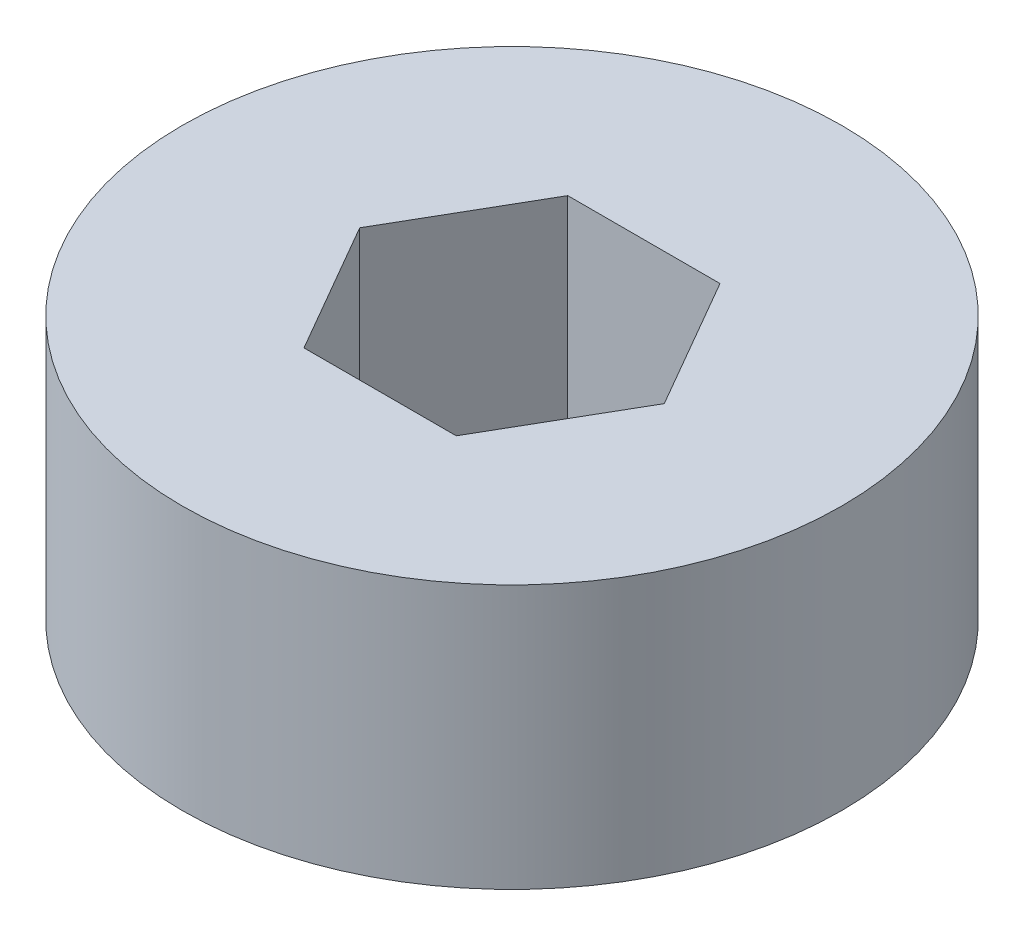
ISO-10303-21;
HEADER;
FILE_DESCRIPTION(('STEP AP214'),'2;1');
FILE_NAME('part.step','',(''),(''),'','','');
FILE_SCHEMA(('AUTOMOTIVE_DESIGN { 1 0 10303 214 1 1 1 1 }'));
ENDSEC;
DATA;
#1=APPLICATION_CONTEXT('core data for automotive mechanical design processes');
#2=APPLICATION_PROTOCOL_DEFINITION('international standard','automotive_design',2000,#1);
#3=PRODUCT_CONTEXT('',#1,'mechanical');
#4=PRODUCT('Part','Part','',(#3));
#5=PRODUCT_RELATED_PRODUCT_CATEGORY('part','',(#4));
#6=PRODUCT_DEFINITION_FORMATION('','',#4);
#7=PRODUCT_DEFINITION_CONTEXT('part definition',#1,'design');
#8=PRODUCT_DEFINITION('design','',#6,#7);
#9=PRODUCT_DEFINITION_SHAPE('','',#8);
#10=(LENGTH_UNIT() NAMED_UNIT(*) SI_UNIT(.MILLI.,.METRE.));
#11=(NAMED_UNIT(*) PLANE_ANGLE_UNIT() SI_UNIT($,.RADIAN.));
#12=(NAMED_UNIT(*) SI_UNIT($,.STERADIAN.) SOLID_ANGLE_UNIT());
#13=UNCERTAINTY_MEASURE_WITH_UNIT(LENGTH_MEASURE(1.E-05),#10,'distance_accuracy_value','');
#14=(GEOMETRIC_REPRESENTATION_CONTEXT(3) GLOBAL_UNCERTAINTY_ASSIGNED_CONTEXT((#13)) GLOBAL_UNIT_ASSIGNED_CONTEXT((#10,
#11,#12)) REPRESENTATION_CONTEXT('',''));
#15=CARTESIAN_POINT('',(0.,0.,0.));
#16=DIRECTION('',(0.,0.,1.));
#17=DIRECTION('',(1.,0.,0.));
#18=AXIS2_PLACEMENT_3D('',#15,#16,#17);
#19=CARTESIAN_POINT('',(0.,10.,0.));
#20=DIRECTION('',(0.,-1.,0.));
#21=DIRECTION('',(0.,0.,-1.));
#22=AXIS2_PLACEMENT_3D('',#19,#20,#21);
#23=CYLINDRICAL_SURFACE('',#22,12.5);
#24=CARTESIAN_POINT('',(0.,10.,0.));
#25=DIRECTION('',(0.,1.,0.));
#26=DIRECTION('',(0.,0.,1.));
#27=AXIS2_PLACEMENT_3D('',#24,#25,#26);
#28=CIRCLE('',#27,12.5);
#29=CARTESIAN_POINT('',(0.,10.,12.5));
#30=VERTEX_POINT('',#29);
#31=EDGE_CURVE('E11',#30,#30,#28,.T.);
#32=ORIENTED_EDGE('',*,*,#31,.F.);
#33=EDGE_LOOP('',(#32));
#34=FACE_BOUND('',#33,.T.);
#35=CARTESIAN_POINT('',(0.,0.,0.));
#36=DIRECTION('',(0.,1.,0.));
#37=DIRECTION('',(0.,0.,1.));
#38=AXIS2_PLACEMENT_3D('',#35,#36,#37);
#39=CIRCLE('',#38,12.5);
#40=CARTESIAN_POINT('',(0.,0.,12.5));
#41=VERTEX_POINT('',#40);
#42=EDGE_CURVE('E35',#41,#41,#39,.T.);
#43=ORIENTED_EDGE('',*,*,#42,.T.);
#44=EDGE_LOOP('',(#43));
#45=FACE_BOUND('',#44,.T.);
#46=ADVANCED_FACE('F28',(#34,#45),#23,.T.);
#47=CARTESIAN_POINT('',(0.,10.,0.));
#48=DIRECTION('',(0.,1.,0.));
#49=DIRECTION('',(0.,0.,1.));
#50=AXIS2_PLACEMENT_3D('',#47,#48,#49);
#51=PLANE('',#50);
#52=DIRECTION('',(0.5,0.,-0.866025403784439));
#53=VECTOR('',#52,1.);
#54=CARTESIAN_POINT('',(2.88675134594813,10.,5.));
#55=LINE('',#54,#53);
#56=CARTESIAN_POINT('',(2.88675134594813,10.,5.));
#57=VERTEX_POINT('',#56);
#58=CARTESIAN_POINT('',(5.77350269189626,10.,0.));
#59=VERTEX_POINT('',#58);
#60=EDGE_CURVE('E42',#57,#59,#55,.T.);
#61=ORIENTED_EDGE('',*,*,#60,.F.);
#62=DIRECTION('',(1.,0.,0.));
#63=VECTOR('',#62,1.);
#64=CARTESIAN_POINT('',(-2.88675134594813,10.,5.));
#65=LINE('',#64,#63);
#66=CARTESIAN_POINT('',(-2.88675134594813,10.,5.));
#67=VERTEX_POINT('',#66);
#68=EDGE_CURVE('E107',#67,#57,#65,.T.);
#69=ORIENTED_EDGE('',*,*,#68,.F.);
#70=DIRECTION('',(0.5,0.,0.866025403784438));
#71=VECTOR('',#70,1.);
#72=CARTESIAN_POINT('',(-5.77350269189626,10.,0.));
#73=LINE('',#72,#71);
#74=CARTESIAN_POINT('',(-5.77350269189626,10.,0.));
#75=VERTEX_POINT('',#74);
#76=EDGE_CURVE('E101',#75,#67,#73,.T.);
#77=ORIENTED_EDGE('',*,*,#76,.F.);
#78=DIRECTION('',(-0.5,0.,0.866025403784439));
#79=VECTOR('',#78,1.);
#80=CARTESIAN_POINT('',(-2.88675134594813,10.,-5.));
#81=LINE('',#80,#79);
#82=CARTESIAN_POINT('',(-2.88675134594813,10.,-5.));
#83=VERTEX_POINT('',#82);
#84=EDGE_CURVE('E99',#83,#75,#81,.T.);
#85=ORIENTED_EDGE('',*,*,#84,.F.);
#86=DIRECTION('',(-1.,0.,0.));
#87=VECTOR('',#86,1.);
#88=CARTESIAN_POINT('',(2.88675134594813,10.,-5.));
#89=LINE('',#88,#87);
#90=CARTESIAN_POINT('',(2.88675134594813,10.,-5.));
#91=VERTEX_POINT('',#90);
#92=EDGE_CURVE('E82',#91,#83,#89,.T.);
#93=ORIENTED_EDGE('',*,*,#92,.F.);
#94=DIRECTION('',(-0.5,0.,-0.866025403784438));
#95=VECTOR('',#94,1.);
#96=CARTESIAN_POINT('',(5.77350269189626,10.,0.));
#97=LINE('',#96,#95);
#98=EDGE_CURVE('E91',#59,#91,#97,.T.);
#99=ORIENTED_EDGE('',*,*,#98,.F.);
#100=EDGE_LOOP('',(#61,#69,#77,#85,#93,#99));
#101=FACE_BOUND('',#100,.T.);
#102=ORIENTED_EDGE('',*,*,#31,.T.);
#103=EDGE_LOOP('',(#102));
#104=FACE_BOUND('',#103,.T.);
#105=ADVANCED_FACE('F95',(#101,#104),#51,.T.);
#106=CARTESIAN_POINT('',(0.,0.,0.));
#107=DIRECTION('',(0.,1.,0.));
#108=DIRECTION('',(0.,0.,1.));
#109=AXIS2_PLACEMENT_3D('',#106,#107,#108);
#110=PLANE('',#109);
#111=DIRECTION('',(1.,0.,0.));
#112=VECTOR('',#111,1.);
#113=CARTESIAN_POINT('',(-2.88675134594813,0.,5.));
#114=LINE('',#113,#112);
#115=CARTESIAN_POINT('',(-2.88675134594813,0.,5.));
#116=VERTEX_POINT('',#115);
#117=CARTESIAN_POINT('',(2.88675134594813,0.,5.));
#118=VERTEX_POINT('',#117);
#119=EDGE_CURVE('E122',#116,#118,#114,.T.);
#120=ORIENTED_EDGE('',*,*,#119,.T.);
#121=DIRECTION('',(0.5,0.,-0.866025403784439));
#122=VECTOR('',#121,1.);
#123=CARTESIAN_POINT('',(2.88675134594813,0.,5.));
#124=LINE('',#123,#122);
#125=CARTESIAN_POINT('',(5.77350269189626,0.,0.));
#126=VERTEX_POINT('',#125);
#127=EDGE_CURVE('E110',#118,#126,#124,.T.);
#128=ORIENTED_EDGE('',*,*,#127,.T.);
#129=DIRECTION('',(-0.5,0.,-0.866025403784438));
#130=VECTOR('',#129,1.);
#131=CARTESIAN_POINT('',(5.77350269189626,0.,0.));
#132=LINE('',#131,#130);
#133=CARTESIAN_POINT('',(2.88675134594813,0.,-5.));
#134=VERTEX_POINT('',#133);
#135=EDGE_CURVE('E113',#126,#134,#132,.T.);
#136=ORIENTED_EDGE('',*,*,#135,.T.);
#137=DIRECTION('',(-1.,0.,0.));
#138=VECTOR('',#137,1.);
#139=CARTESIAN_POINT('',(2.88675134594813,0.,-5.));
#140=LINE('',#139,#138);
#141=CARTESIAN_POINT('',(-2.88675134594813,0.,-5.));
#142=VERTEX_POINT('',#141);
#143=EDGE_CURVE('E50',#134,#142,#140,.T.);
#144=ORIENTED_EDGE('',*,*,#143,.T.);
#145=DIRECTION('',(-0.5,0.,0.866025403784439));
#146=VECTOR('',#145,1.);
#147=CARTESIAN_POINT('',(-2.88675134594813,0.,-5.));
#148=LINE('',#147,#146);
#149=CARTESIAN_POINT('',(-5.77350269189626,0.,0.));
#150=VERTEX_POINT('',#149);
#151=EDGE_CURVE('E116',#142,#150,#148,.T.);
#152=ORIENTED_EDGE('',*,*,#151,.T.);
#153=DIRECTION('',(0.5,0.,0.866025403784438));
#154=VECTOR('',#153,1.);
#155=CARTESIAN_POINT('',(-5.77350269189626,0.,0.));
#156=LINE('',#155,#154);
#157=EDGE_CURVE('E119',#150,#116,#156,.T.);
#158=ORIENTED_EDGE('',*,*,#157,.T.);
#159=EDGE_LOOP('',(#120,#128,#136,#144,#152,#158));
#160=FACE_BOUND('',#159,.T.);
#161=ORIENTED_EDGE('',*,*,#42,.F.);
#162=EDGE_LOOP('',(#161));
#163=FACE_BOUND('',#162,.T.);
#164=ADVANCED_FACE('F136',(#160,#163),#110,.F.);
#165=CARTESIAN_POINT('',(2.88675134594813,0.,5.));
#166=DIRECTION('',(0.866025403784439,0.,0.5));
#167=DIRECTION('',(0.5,0.,-0.866025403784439));
#168=AXIS2_PLACEMENT_3D('',#165,#166,#167);
#169=PLANE('',#168);
#170=ORIENTED_EDGE('',*,*,#60,.T.);
#171=DIRECTION('',(0.,1.,0.));
#172=VECTOR('',#171,1.);
#173=CARTESIAN_POINT('',(5.77350269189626,0.,0.));
#174=LINE('',#173,#172);
#175=EDGE_CURVE('E88',#126,#59,#174,.T.);
#176=ORIENTED_EDGE('',*,*,#175,.F.);
#177=ORIENTED_EDGE('',*,*,#127,.F.);
#178=DIRECTION('',(0.,1.,0.));
#179=VECTOR('',#178,1.);
#180=CARTESIAN_POINT('',(2.88675134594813,0.,5.));
#181=LINE('',#180,#179);
#182=EDGE_CURVE('E125',#118,#57,#181,.T.);
#183=ORIENTED_EDGE('',*,*,#182,.T.);
#184=EDGE_LOOP('',(#170,#176,#177,#183));
#185=FACE_BOUND('',#184,.T.);
#186=ADVANCED_FACE('F138',(#185),#169,.F.);
#187=CARTESIAN_POINT('',(-2.88675134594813,0.,5.));
#188=DIRECTION('',(0.,0.,1.));
#189=DIRECTION('',(1.,0.,0.));
#190=AXIS2_PLACEMENT_3D('',#187,#188,#189);
#191=PLANE('',#190);
#192=ORIENTED_EDGE('',*,*,#68,.T.);
#193=ORIENTED_EDGE('',*,*,#182,.F.);
#194=ORIENTED_EDGE('',*,*,#119,.F.);
#195=DIRECTION('',(0.,1.,0.));
#196=VECTOR('',#195,1.);
#197=CARTESIAN_POINT('',(-2.88675134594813,0.,5.));
#198=LINE('',#197,#196);
#199=EDGE_CURVE('E127',#116,#67,#198,.T.);
#200=ORIENTED_EDGE('',*,*,#199,.T.);
#201=EDGE_LOOP('',(#192,#193,#194,#200));
#202=FACE_BOUND('',#201,.T.);
#203=ADVANCED_FACE('F145',(#202),#191,.F.);
#204=CARTESIAN_POINT('',(-5.77350269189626,0.,0.));
#205=DIRECTION('',(-0.866025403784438,0.,0.5));
#206=DIRECTION('',(0.5,0.,0.866025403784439));
#207=AXIS2_PLACEMENT_3D('',#204,#205,#206);
#208=PLANE('',#207);
#209=ORIENTED_EDGE('',*,*,#76,.T.);
#210=ORIENTED_EDGE('',*,*,#199,.F.);
#211=ORIENTED_EDGE('',*,*,#157,.F.);
#212=DIRECTION('',(0.,1.,0.));
#213=VECTOR('',#212,1.);
#214=CARTESIAN_POINT('',(-5.77350269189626,0.,0.));
#215=LINE('',#214,#213);
#216=EDGE_CURVE('E129',#150,#75,#215,.T.);
#217=ORIENTED_EDGE('',*,*,#216,.T.);
#218=EDGE_LOOP('',(#209,#210,#211,#217));
#219=FACE_BOUND('',#218,.T.);
#220=ADVANCED_FACE('F169',(#219),#208,.F.);
#221=CARTESIAN_POINT('',(-2.88675134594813,0.,-5.));
#222=DIRECTION('',(-0.866025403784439,0.,-0.5));
#223=DIRECTION('',(-0.5,0.,0.866025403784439));
#224=AXIS2_PLACEMENT_3D('',#221,#222,#223);
#225=PLANE('',#224);
#226=ORIENTED_EDGE('',*,*,#84,.T.);
#227=ORIENTED_EDGE('',*,*,#216,.F.);
#228=ORIENTED_EDGE('',*,*,#151,.F.);
#229=DIRECTION('',(0.,1.,0.));
#230=VECTOR('',#229,1.);
#231=CARTESIAN_POINT('',(-2.88675134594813,0.,-5.));
#232=LINE('',#231,#230);
#233=EDGE_CURVE('E87',#142,#83,#232,.T.);
#234=ORIENTED_EDGE('',*,*,#233,.T.);
#235=EDGE_LOOP('',(#226,#227,#228,#234));
#236=FACE_BOUND('',#235,.T.);
#237=ADVANCED_FACE('F177',(#236),#225,.F.);
#238=CARTESIAN_POINT('',(2.88675134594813,0.,-5.));
#239=DIRECTION('',(0.,0.,-1.));
#240=DIRECTION('',(-1.,0.,0.));
#241=AXIS2_PLACEMENT_3D('',#238,#239,#240);
#242=PLANE('',#241);
#243=ORIENTED_EDGE('',*,*,#92,.T.);
#244=ORIENTED_EDGE('',*,*,#233,.F.);
#245=ORIENTED_EDGE('',*,*,#143,.F.);
#246=DIRECTION('',(0.,1.,0.));
#247=VECTOR('',#246,1.);
#248=CARTESIAN_POINT('',(2.88675134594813,0.,-5.));
#249=LINE('',#248,#247);
#250=EDGE_CURVE('E78',#134,#91,#249,.T.);
#251=ORIENTED_EDGE('',*,*,#250,.T.);
#252=EDGE_LOOP('',(#243,#244,#245,#251));
#253=FACE_BOUND('',#252,.T.);
#254=ADVANCED_FACE('F80',(#253),#242,.F.);
#255=CARTESIAN_POINT('',(5.77350269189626,0.,0.));
#256=DIRECTION('',(0.866025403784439,0.,-0.5));
#257=DIRECTION('',(-0.5,0.,-0.866025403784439));
#258=AXIS2_PLACEMENT_3D('',#255,#256,#257);
#259=PLANE('',#258);
#260=ORIENTED_EDGE('',*,*,#98,.T.);
#261=ORIENTED_EDGE('',*,*,#250,.F.);
#262=ORIENTED_EDGE('',*,*,#135,.F.);
#263=ORIENTED_EDGE('',*,*,#175,.T.);
#264=EDGE_LOOP('',(#260,#261,#262,#263));
#265=FACE_BOUND('',#264,.T.);
#266=ADVANCED_FACE('F92',(#265),#259,.F.);
#267=CLOSED_SHELL('',(#46,#105,#164,#186,#203,#220,#237,#254,#266));
#268=MANIFOLD_SOLID_BREP('B2',#267);
#269=ADVANCED_BREP_SHAPE_REPRESENTATION('',(#18,#268),#14);
#270=SHAPE_DEFINITION_REPRESENTATION(#9,#269);
ENDSEC;
END-ISO-10303-21;
